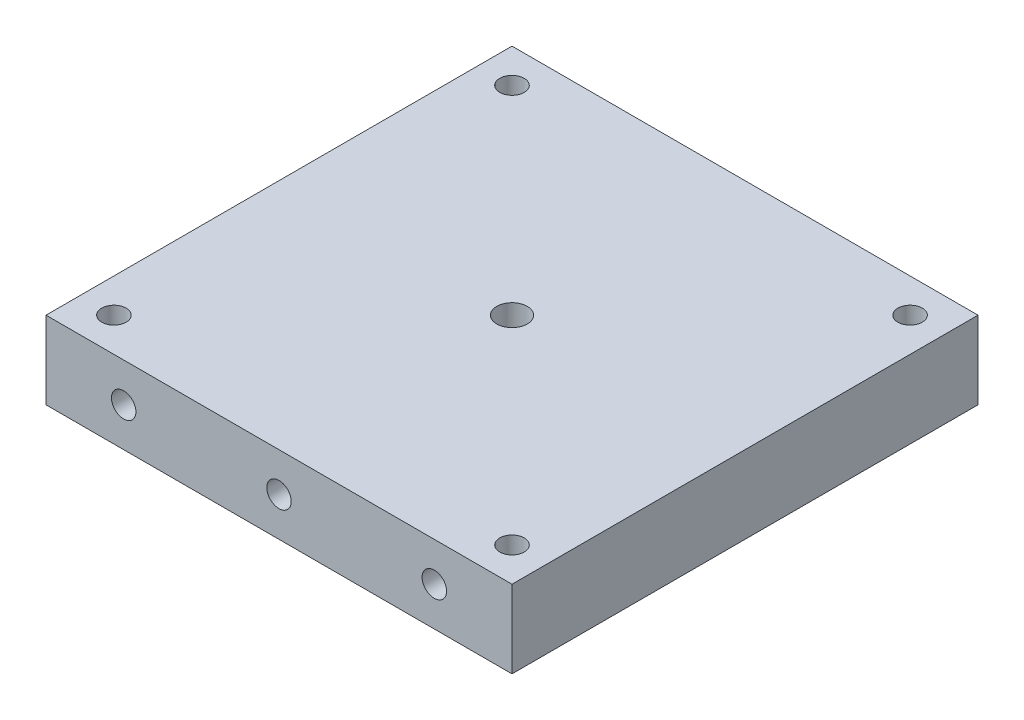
ISO-10303-21;
HEADER;
FILE_DESCRIPTION(('STEP AP214'),'2;1');
FILE_NAME('part.step','',(''),(''),'','','');
FILE_SCHEMA(('AUTOMOTIVE_DESIGN { 1 0 10303 214 1 1 1 1 }'));
ENDSEC;
DATA;
#1=APPLICATION_CONTEXT('core data for automotive mechanical design processes');
#2=APPLICATION_PROTOCOL_DEFINITION('international standard','automotive_design',2000,#1);
#3=PRODUCT_CONTEXT('',#1,'mechanical');
#4=PRODUCT('Part','Part','',(#3));
#5=PRODUCT_RELATED_PRODUCT_CATEGORY('part','',(#4));
#6=PRODUCT_DEFINITION_FORMATION('','',#4);
#7=PRODUCT_DEFINITION_CONTEXT('part definition',#1,'design');
#8=PRODUCT_DEFINITION('design','',#6,#7);
#9=PRODUCT_DEFINITION_SHAPE('','',#8);
#10=(LENGTH_UNIT() NAMED_UNIT(*) SI_UNIT(.MILLI.,.METRE.));
#11=(NAMED_UNIT(*) PLANE_ANGLE_UNIT() SI_UNIT($,.RADIAN.));
#12=(NAMED_UNIT(*) SI_UNIT($,.STERADIAN.) SOLID_ANGLE_UNIT());
#13=UNCERTAINTY_MEASURE_WITH_UNIT(LENGTH_MEASURE(1.E-05),#10,'distance_accuracy_value','');
#14=(GEOMETRIC_REPRESENTATION_CONTEXT(3) GLOBAL_UNCERTAINTY_ASSIGNED_CONTEXT((#13)) GLOBAL_UNIT_ASSIGNED_CONTEXT((#10,
#11,#12)) REPRESENTATION_CONTEXT('',''));
#15=CARTESIAN_POINT('',(0.,0.,0.));
#16=DIRECTION('',(0.,0.,1.));
#17=DIRECTION('',(1.,0.,0.));
#18=AXIS2_PLACEMENT_3D('',#15,#16,#17);
#19=CARTESIAN_POINT('',(-64.5530388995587,12.7,-17.4419074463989));
#20=DIRECTION('',(1.,0.,0.));
#21=DIRECTION('',(0.,0.,-1.));
#22=AXIS2_PLACEMENT_3D('',#19,#20,#21);
#23=PLANE('',#22);
#24=DIRECTION('',(0.,0.,1.));
#25=VECTOR('',#24,1.);
#26=CARTESIAN_POINT('',(-64.5530388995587,0.,-17.4419074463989));
#27=LINE('',#26,#25);
#28=CARTESIAN_POINT('',(-64.5530388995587,0.,-17.4419074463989));
#29=VERTEX_POINT('',#28);
#30=CARTESIAN_POINT('',(-64.5530388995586,0.,58.7580925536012));
#31=VERTEX_POINT('',#30);
#32=EDGE_CURVE('E149',#29,#31,#27,.T.);
#33=ORIENTED_EDGE('',*,*,#32,.T.);
#34=DIRECTION('',(0.,-1.,0.));
#35=VECTOR('',#34,1.);
#36=CARTESIAN_POINT('',(-64.5530388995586,12.7,58.7580925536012));
#37=LINE('',#36,#35);
#38=CARTESIAN_POINT('',(-64.5530388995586,12.7,58.7580925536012));
#39=VERTEX_POINT('',#38);
#40=EDGE_CURVE('E11',#39,#31,#37,.T.);
#41=ORIENTED_EDGE('',*,*,#40,.F.);
#42=DIRECTION('',(0.,0.,1.));
#43=VECTOR('',#42,1.);
#44=CARTESIAN_POINT('',(-64.5530388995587,12.7,-17.4419074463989));
#45=LINE('',#44,#43);
#46=CARTESIAN_POINT('',(-64.5530388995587,12.7,-17.4419074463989));
#47=VERTEX_POINT('',#46);
#48=EDGE_CURVE('E150',#47,#39,#45,.T.);
#49=ORIENTED_EDGE('',*,*,#48,.F.);
#50=DIRECTION('',(0.,-1.,0.));
#51=VECTOR('',#50,1.);
#52=CARTESIAN_POINT('',(-64.5530388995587,12.7,-17.4419074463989));
#53=LINE('',#52,#51);
#54=EDGE_CURVE('E156',#47,#29,#53,.T.);
#55=ORIENTED_EDGE('',*,*,#54,.T.);
#56=EDGE_LOOP('',(#33,#41,#49,#55));
#57=FACE_BOUND('',#56,.T.);
#58=ADVANCED_FACE('F32',(#57),#23,.F.);
#59=CARTESIAN_POINT('',(-64.5530388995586,12.7,58.7580925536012));
#60=DIRECTION('',(0.,0.,-1.));
#61=DIRECTION('',(-1.,0.,0.));
#62=AXIS2_PLACEMENT_3D('',#59,#60,#61);
#63=PLANE('',#62);
#64=CARTESIAN_POINT('',(-1.05303889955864,6.35,58.7580925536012));
#65=DIRECTION('',(0.,0.,1.));
#66=DIRECTION('',(1.,0.,0.));
#67=AXIS2_PLACEMENT_3D('',#64,#65,#66);
#68=CIRCLE('',#67,2.);
#69=CARTESIAN_POINT('',(0.946961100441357,6.35,58.7580925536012));
#70=VERTEX_POINT('',#69);
#71=EDGE_CURVE('E125',#70,#70,#68,.T.);
#72=ORIENTED_EDGE('',*,*,#71,.F.);
#73=EDGE_LOOP('',(#72));
#74=FACE_BOUND('',#73,.T.);
#75=CARTESIAN_POINT('',(-26.4530388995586,6.35,58.7580925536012));
#76=DIRECTION('',(0.,0.,1.));
#77=DIRECTION('',(1.,0.,0.));
#78=AXIS2_PLACEMENT_3D('',#75,#76,#77);
#79=CIRCLE('',#78,2.);
#80=CARTESIAN_POINT('',(-24.4530388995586,6.35,58.7580925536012));
#81=VERTEX_POINT('',#80);
#82=EDGE_CURVE('E129',#81,#81,#79,.T.);
#83=ORIENTED_EDGE('',*,*,#82,.F.);
#84=EDGE_LOOP('',(#83));
#85=FACE_BOUND('',#84,.T.);
#86=CARTESIAN_POINT('',(-51.8530388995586,6.35,58.7580925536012));
#87=DIRECTION('',(0.,0.,1.));
#88=DIRECTION('',(1.,0.,0.));
#89=AXIS2_PLACEMENT_3D('',#86,#87,#88);
#90=CIRCLE('',#89,2.);
#91=CARTESIAN_POINT('',(-49.8530388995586,6.35,58.7580925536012));
#92=VERTEX_POINT('',#91);
#93=EDGE_CURVE('E135',#92,#92,#90,.T.);
#94=ORIENTED_EDGE('',*,*,#93,.F.);
#95=EDGE_LOOP('',(#94));
#96=FACE_BOUND('',#95,.T.);
#97=DIRECTION('',(1.,0.,0.));
#98=VECTOR('',#97,1.);
#99=CARTESIAN_POINT('',(-64.5530388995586,0.,58.7580925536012));
#100=LINE('',#99,#98);
#101=CARTESIAN_POINT('',(11.6469611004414,0.,58.7580925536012));
#102=VERTEX_POINT('',#101);
#103=EDGE_CURVE('E159',#31,#102,#100,.T.);
#104=ORIENTED_EDGE('',*,*,#103,.T.);
#105=DIRECTION('',(0.,-1.,0.));
#106=VECTOR('',#105,1.);
#107=CARTESIAN_POINT('',(11.6469611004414,12.7,58.7580925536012));
#108=LINE('',#107,#106);
#109=CARTESIAN_POINT('',(11.6469611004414,12.7,58.7580925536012));
#110=VERTEX_POINT('',#109);
#111=EDGE_CURVE('E40',#110,#102,#108,.T.);
#112=ORIENTED_EDGE('',*,*,#111,.F.);
#113=DIRECTION('',(1.,0.,0.));
#114=VECTOR('',#113,1.);
#115=CARTESIAN_POINT('',(-64.5530388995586,12.7,58.7580925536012));
#116=LINE('',#115,#114);
#117=EDGE_CURVE('E79',#39,#110,#116,.T.);
#118=ORIENTED_EDGE('',*,*,#117,.F.);
#119=ORIENTED_EDGE('',*,*,#40,.T.);
#120=EDGE_LOOP('',(#104,#112,#118,#119));
#121=FACE_BOUND('',#120,.T.);
#122=ADVANCED_FACE('F183',(#74,#85,#96,#121),#63,.F.);
#123=CARTESIAN_POINT('',(11.6469611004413,12.7,-17.4419074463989));
#124=DIRECTION('',(-1.,0.,0.));
#125=DIRECTION('',(0.,0.,1.));
#126=AXIS2_PLACEMENT_3D('',#123,#124,#125);
#127=PLANE('',#126);
#128=DIRECTION('',(0.,0.,-1.));
#129=VECTOR('',#128,1.);
#130=CARTESIAN_POINT('',(11.6469611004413,0.,-17.4419074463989));
#131=LINE('',#130,#129);
#132=CARTESIAN_POINT('',(11.6469611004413,0.,-17.4419074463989));
#133=VERTEX_POINT('',#132);
#134=EDGE_CURVE('E66',#102,#133,#131,.T.);
#135=ORIENTED_EDGE('',*,*,#134,.T.);
#136=DIRECTION('',(0.,-1.,0.));
#137=VECTOR('',#136,1.);
#138=CARTESIAN_POINT('',(11.6469611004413,12.7,-17.4419074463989));
#139=LINE('',#138,#137);
#140=CARTESIAN_POINT('',(11.6469611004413,12.7,-17.4419074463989));
#141=VERTEX_POINT('',#140);
#142=EDGE_CURVE('E164',#141,#133,#139,.T.);
#143=ORIENTED_EDGE('',*,*,#142,.F.);
#144=DIRECTION('',(0.,0.,-1.));
#145=VECTOR('',#144,1.);
#146=CARTESIAN_POINT('',(11.6469611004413,12.7,-17.4419074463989));
#147=LINE('',#146,#145);
#148=EDGE_CURVE('E153',#110,#141,#147,.T.);
#149=ORIENTED_EDGE('',*,*,#148,.F.);
#150=ORIENTED_EDGE('',*,*,#111,.T.);
#151=EDGE_LOOP('',(#135,#143,#149,#150));
#152=FACE_BOUND('',#151,.T.);
#153=ADVANCED_FACE('F166',(#152),#127,.F.);
#154=CARTESIAN_POINT('',(-64.5530388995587,12.7,-17.4419074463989));
#155=DIRECTION('',(0.,0.,1.));
#156=DIRECTION('',(1.,0.,0.));
#157=AXIS2_PLACEMENT_3D('',#154,#155,#156);
#158=PLANE('',#157);
#159=DIRECTION('',(-1.,0.,0.));
#160=VECTOR('',#159,1.);
#161=CARTESIAN_POINT('',(-64.5530388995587,0.,-17.4419074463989));
#162=LINE('',#161,#160);
#163=EDGE_CURVE('E72',#133,#29,#162,.T.);
#164=ORIENTED_EDGE('',*,*,#163,.T.);
#165=ORIENTED_EDGE('',*,*,#54,.F.);
#166=DIRECTION('',(-1.,0.,0.));
#167=VECTOR('',#166,1.);
#168=CARTESIAN_POINT('',(-64.5530388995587,12.7,-17.4419074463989));
#169=LINE('',#168,#167);
#170=EDGE_CURVE('E48',#141,#47,#169,.T.);
#171=ORIENTED_EDGE('',*,*,#170,.F.);
#172=ORIENTED_EDGE('',*,*,#142,.T.);
#173=EDGE_LOOP('',(#164,#165,#171,#172));
#174=FACE_BOUND('',#173,.T.);
#175=ADVANCED_FACE('F173',(#174),#158,.F.);
#176=CARTESIAN_POINT('',(-64.5530388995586,12.7,58.7580925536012));
#177=DIRECTION('',(0.,1.,0.));
#178=DIRECTION('',(0.,0.,1.));
#179=AXIS2_PLACEMENT_3D('',#176,#177,#178);
#180=PLANE('',#179);
#181=CARTESIAN_POINT('',(-58.9967888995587,12.7,-11.8856574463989));
#182=DIRECTION('',(0.,1.,0.));
#183=DIRECTION('',(0.,0.,1.));
#184=AXIS2_PLACEMENT_3D('',#181,#182,#183);
#185=CIRCLE('',#184,1.99999999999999);
#186=CARTESIAN_POINT('',(-58.9967888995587,12.7,-9.88565744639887));
#187=VERTEX_POINT('',#186);
#188=EDGE_CURVE('E103',#187,#187,#185,.T.);
#189=ORIENTED_EDGE('',*,*,#188,.F.);
#190=EDGE_LOOP('',(#189));
#191=FACE_BOUND('',#190,.T.);
#192=CARTESIAN_POINT('',(6.09071110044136,12.7,-11.8856574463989));
#193=DIRECTION('',(0.,1.,0.));
#194=DIRECTION('',(0.,0.,1.));
#195=AXIS2_PLACEMENT_3D('',#192,#193,#194);
#196=CIRCLE('',#195,1.99999999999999);
#197=CARTESIAN_POINT('',(6.09071110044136,12.7,-9.88565744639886));
#198=VERTEX_POINT('',#197);
#199=EDGE_CURVE('E102',#198,#198,#196,.T.);
#200=ORIENTED_EDGE('',*,*,#199,.F.);
#201=EDGE_LOOP('',(#200));
#202=FACE_BOUND('',#201,.T.);
#203=CARTESIAN_POINT('',(6.09071110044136,12.7,53.2018425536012));
#204=DIRECTION('',(0.,1.,0.));
#205=DIRECTION('',(0.,0.,1.));
#206=AXIS2_PLACEMENT_3D('',#203,#204,#205);
#207=CIRCLE('',#206,1.99999999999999);
#208=CARTESIAN_POINT('',(6.09071110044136,12.7,55.2018425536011));
#209=VERTEX_POINT('',#208);
#210=EDGE_CURVE('E113',#209,#209,#207,.T.);
#211=ORIENTED_EDGE('',*,*,#210,.F.);
#212=EDGE_LOOP('',(#211));
#213=FACE_BOUND('',#212,.T.);
#214=CARTESIAN_POINT('',(-58.9967888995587,12.7,53.2018425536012));
#215=DIRECTION('',(0.,1.,0.));
#216=DIRECTION('',(0.,0.,1.));
#217=AXIS2_PLACEMENT_3D('',#214,#215,#216);
#218=CIRCLE('',#217,1.99999999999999);
#219=CARTESIAN_POINT('',(-58.9967888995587,12.7,55.2018425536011));
#220=VERTEX_POINT('',#219);
#221=EDGE_CURVE('E119',#220,#220,#218,.T.);
#222=ORIENTED_EDGE('',*,*,#221,.F.);
#223=EDGE_LOOP('',(#222));
#224=FACE_BOUND('',#223,.T.);
#225=CARTESIAN_POINT('',(-26.4530388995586,12.7,20.6580925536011));
#226=DIRECTION('',(0.,1.,0.));
#227=DIRECTION('',(0.,0.,1.));
#228=AXIS2_PLACEMENT_3D('',#225,#226,#227);
#229=CIRCLE('',#228,2.49999999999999);
#230=CARTESIAN_POINT('',(-26.4530388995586,12.7,23.1580925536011));
#231=VERTEX_POINT('',#230);
#232=EDGE_CURVE('E141',#231,#231,#229,.T.);
#233=ORIENTED_EDGE('',*,*,#232,.F.);
#234=EDGE_LOOP('',(#233));
#235=FACE_BOUND('',#234,.T.);
#236=ORIENTED_EDGE('',*,*,#48,.T.);
#237=ORIENTED_EDGE('',*,*,#117,.T.);
#238=ORIENTED_EDGE('',*,*,#148,.T.);
#239=ORIENTED_EDGE('',*,*,#170,.T.);
#240=EDGE_LOOP('',(#236,#237,#238,#239));
#241=FACE_BOUND('',#240,.T.);
#242=ADVANCED_FACE('F175',(#191,#202,#213,#224,#235,#241),#180,.T.);
#243=CARTESIAN_POINT('',(-64.5530388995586,0.,58.7580925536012));
#244=DIRECTION('',(0.,1.,0.));
#245=DIRECTION('',(0.,0.,1.));
#246=AXIS2_PLACEMENT_3D('',#243,#244,#245);
#247=PLANE('',#246);
#248=CARTESIAN_POINT('',(-26.4530388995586,0.,20.6580925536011));
#249=DIRECTION('',(0.,1.,0.));
#250=DIRECTION('',(0.,0.,1.));
#251=AXIS2_PLACEMENT_3D('',#248,#249,#250);
#252=CIRCLE('',#251,2.5);
#253=CARTESIAN_POINT('',(-26.4530388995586,0.,23.1580925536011));
#254=VERTEX_POINT('',#253);
#255=EDGE_CURVE('E146',#254,#254,#252,.T.);
#256=ORIENTED_EDGE('',*,*,#255,.T.);
#257=EDGE_LOOP('',(#256));
#258=FACE_BOUND('',#257,.T.);
#259=ORIENTED_EDGE('',*,*,#32,.F.);
#260=ORIENTED_EDGE('',*,*,#163,.F.);
#261=ORIENTED_EDGE('',*,*,#134,.F.);
#262=ORIENTED_EDGE('',*,*,#103,.F.);
#263=EDGE_LOOP('',(#259,#260,#261,#262));
#264=FACE_BOUND('',#263,.T.);
#265=ADVANCED_FACE('F169',(#258,#264),#247,.F.);
#266=CARTESIAN_POINT('',(-26.4530388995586,12.7,20.6580925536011));
#267=DIRECTION('',(0.,1.,0.));
#268=DIRECTION('',(0.,0.,1.));
#269=AXIS2_PLACEMENT_3D('',#266,#267,#268);
#270=CYLINDRICAL_SURFACE('',#269,2.49999999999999);
#271=ORIENTED_EDGE('',*,*,#255,.F.);
#272=EDGE_LOOP('',(#271));
#273=FACE_BOUND('',#272,.T.);
#274=ORIENTED_EDGE('',*,*,#232,.T.);
#275=EDGE_LOOP('',(#274));
#276=FACE_BOUND('',#275,.T.);
#277=ADVANCED_FACE('F202',(#273,#276),#270,.F.);
#278=CARTESIAN_POINT('',(-51.8530388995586,6.35,33.3580925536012));
#279=DIRECTION('',(0.,0.,1.));
#280=DIRECTION('',(1.,0.,0.));
#281=AXIS2_PLACEMENT_3D('',#278,#279,#280);
#282=CYLINDRICAL_SURFACE('',#281,2.);
#283=CARTESIAN_POINT('',(-51.8530388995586,6.35,33.3580925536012));
#284=DIRECTION('',(0.,0.,1.));
#285=DIRECTION('',(1.,0.,0.));
#286=AXIS2_PLACEMENT_3D('',#283,#284,#285);
#287=CIRCLE('',#286,2.);
#288=CARTESIAN_POINT('',(-49.8530388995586,6.35,33.3580925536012));
#289=VERTEX_POINT('',#288);
#290=EDGE_CURVE('E138',#289,#289,#287,.T.);
#291=ORIENTED_EDGE('',*,*,#290,.F.);
#292=EDGE_LOOP('',(#291));
#293=FACE_BOUND('',#292,.T.);
#294=ORIENTED_EDGE('',*,*,#93,.T.);
#295=EDGE_LOOP('',(#294));
#296=FACE_BOUND('',#295,.T.);
#297=ADVANCED_FACE('F199',(#293,#296),#282,.F.);
#298=CARTESIAN_POINT('',(-51.8530388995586,6.35,33.3580925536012));
#299=DIRECTION('',(0.,0.,1.));
#300=DIRECTION('',(1.,0.,0.));
#301=AXIS2_PLACEMENT_3D('',#298,#299,#300);
#302=PLANE('',#301);
#303=ORIENTED_EDGE('',*,*,#290,.T.);
#304=EDGE_LOOP('',(#303));
#305=FACE_BOUND('',#304,.T.);
#306=ADVANCED_FACE('F201',(#305),#302,.T.);
#307=CARTESIAN_POINT('',(-26.4530388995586,6.35,33.3580925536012));
#308=DIRECTION('',(0.,0.,1.));
#309=DIRECTION('',(1.,0.,0.));
#310=AXIS2_PLACEMENT_3D('',#307,#308,#309);
#311=CYLINDRICAL_SURFACE('',#310,2.);
#312=CARTESIAN_POINT('',(-26.4530388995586,6.35,33.3580925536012));
#313=DIRECTION('',(0.,0.,1.));
#314=DIRECTION('',(1.,0.,0.));
#315=AXIS2_PLACEMENT_3D('',#312,#313,#314);
#316=CIRCLE('',#315,2.);
#317=CARTESIAN_POINT('',(-24.4530388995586,6.35,33.3580925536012));
#318=VERTEX_POINT('',#317);
#319=EDGE_CURVE('E132',#318,#318,#316,.T.);
#320=ORIENTED_EDGE('',*,*,#319,.F.);
#321=EDGE_LOOP('',(#320));
#322=FACE_BOUND('',#321,.T.);
#323=ORIENTED_EDGE('',*,*,#82,.T.);
#324=EDGE_LOOP('',(#323));
#325=FACE_BOUND('',#324,.T.);
#326=ADVANCED_FACE('F209',(#322,#325),#311,.F.);
#327=CARTESIAN_POINT('',(-26.4530388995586,6.35,33.3580925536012));
#328=DIRECTION('',(0.,0.,1.));
#329=DIRECTION('',(1.,0.,0.));
#330=AXIS2_PLACEMENT_3D('',#327,#328,#329);
#331=PLANE('',#330);
#332=ORIENTED_EDGE('',*,*,#319,.T.);
#333=EDGE_LOOP('',(#332));
#334=FACE_BOUND('',#333,.T.);
#335=ADVANCED_FACE('F255',(#334),#331,.T.);
#336=CARTESIAN_POINT('',(-1.05303889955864,6.35,33.3580925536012));
#337=DIRECTION('',(0.,0.,1.));
#338=DIRECTION('',(1.,0.,0.));
#339=AXIS2_PLACEMENT_3D('',#336,#337,#338);
#340=CYLINDRICAL_SURFACE('',#339,2.);
#341=CARTESIAN_POINT('',(-1.05303889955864,6.35,33.3580925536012));
#342=DIRECTION('',(0.,0.,1.));
#343=DIRECTION('',(1.,0.,0.));
#344=AXIS2_PLACEMENT_3D('',#341,#342,#343);
#345=CIRCLE('',#344,2.);
#346=CARTESIAN_POINT('',(0.946961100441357,6.35,33.3580925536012));
#347=VERTEX_POINT('',#346);
#348=EDGE_CURVE('E126',#347,#347,#345,.T.);
#349=ORIENTED_EDGE('',*,*,#348,.F.);
#350=EDGE_LOOP('',(#349));
#351=FACE_BOUND('',#350,.T.);
#352=ORIENTED_EDGE('',*,*,#71,.T.);
#353=EDGE_LOOP('',(#352));
#354=FACE_BOUND('',#353,.T.);
#355=ADVANCED_FACE('F264',(#351,#354),#340,.F.);
#356=CARTESIAN_POINT('',(-1.05303889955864,6.35,33.3580925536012));
#357=DIRECTION('',(0.,0.,1.));
#358=DIRECTION('',(1.,0.,0.));
#359=AXIS2_PLACEMENT_3D('',#356,#357,#358);
#360=PLANE('',#359);
#361=ORIENTED_EDGE('',*,*,#348,.T.);
#362=EDGE_LOOP('',(#361));
#363=FACE_BOUND('',#362,.T.);
#364=ADVANCED_FACE('F274',(#363),#360,.T.);
#365=CARTESIAN_POINT('',(-58.9967888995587,6.35,53.2018425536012));
#366=DIRECTION('',(0.,1.,0.));
#367=DIRECTION('',(0.,0.,1.));
#368=AXIS2_PLACEMENT_3D('',#365,#366,#367);
#369=CONICAL_SURFACE('',#368,1.99999999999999,1.02974425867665);
#370=CARTESIAN_POINT('',(-58.9967888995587,5.14827876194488,53.2018425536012));
#371=VERTEX_POINT('',#370);
#372=VERTEX_LOOP('',#371);
#373=FACE_BOUND('',#372,.T.);
#374=CARTESIAN_POINT('',(-58.9967888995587,6.35,53.2018425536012));
#375=DIRECTION('',(0.,1.,0.));
#376=DIRECTION('',(0.,0.,1.));
#377=AXIS2_PLACEMENT_3D('',#374,#375,#376);
#378=CIRCLE('',#377,1.99999999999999);
#379=CARTESIAN_POINT('',(-58.9967888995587,6.35,55.2018425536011));
#380=VERTEX_POINT('',#379);
#381=EDGE_CURVE('E122',#380,#380,#378,.T.);
#382=ORIENTED_EDGE('',*,*,#381,.T.);
#383=EDGE_LOOP('',(#382));
#384=FACE_BOUND('',#383,.T.);
#385=ADVANCED_FACE('F283',(#373,#384),#369,.F.);
#386=CARTESIAN_POINT('',(-58.9967888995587,12.7,53.2018425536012));
#387=DIRECTION('',(0.,1.,0.));
#388=DIRECTION('',(0.,0.,1.));
#389=AXIS2_PLACEMENT_3D('',#386,#387,#388);
#390=CYLINDRICAL_SURFACE('',#389,1.99999999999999);
#391=ORIENTED_EDGE('',*,*,#381,.F.);
#392=EDGE_LOOP('',(#391));
#393=FACE_BOUND('',#392,.T.);
#394=ORIENTED_EDGE('',*,*,#221,.T.);
#395=EDGE_LOOP('',(#394));
#396=FACE_BOUND('',#395,.T.);
#397=ADVANCED_FACE('F299',(#393,#396),#390,.F.);
#398=CARTESIAN_POINT('',(6.09071110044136,6.35,53.2018425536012));
#399=DIRECTION('',(0.,1.,0.));
#400=DIRECTION('',(0.,0.,1.));
#401=AXIS2_PLACEMENT_3D('',#398,#399,#400);
#402=CONICAL_SURFACE('',#401,2.,1.02974425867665);
#403=CARTESIAN_POINT('',(6.09071110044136,5.14827876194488,53.2018425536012));
#404=VERTEX_POINT('',#403);
#405=VERTEX_LOOP('',#404);
#406=FACE_BOUND('',#405,.T.);
#407=CARTESIAN_POINT('',(6.09071110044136,6.35,53.2018425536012));
#408=DIRECTION('',(0.,1.,0.));
#409=DIRECTION('',(0.,0.,1.));
#410=AXIS2_PLACEMENT_3D('',#407,#408,#409);
#411=CIRCLE('',#410,2.);
#412=CARTESIAN_POINT('',(6.09071110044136,6.35,55.2018425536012));
#413=VERTEX_POINT('',#412);
#414=EDGE_CURVE('E116',#413,#413,#411,.T.);
#415=ORIENTED_EDGE('',*,*,#414,.T.);
#416=EDGE_LOOP('',(#415));
#417=FACE_BOUND('',#416,.T.);
#418=ADVANCED_FACE('F309',(#406,#417),#402,.F.);
#419=CARTESIAN_POINT('',(6.09071110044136,12.7,53.2018425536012));
#420=DIRECTION('',(0.,1.,0.));
#421=DIRECTION('',(0.,0.,1.));
#422=AXIS2_PLACEMENT_3D('',#419,#420,#421);
#423=CYLINDRICAL_SURFACE('',#422,1.99999999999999);
#424=ORIENTED_EDGE('',*,*,#414,.F.);
#425=EDGE_LOOP('',(#424));
#426=FACE_BOUND('',#425,.T.);
#427=ORIENTED_EDGE('',*,*,#210,.T.);
#428=EDGE_LOOP('',(#427));
#429=FACE_BOUND('',#428,.T.);
#430=ADVANCED_FACE('F319',(#426,#429),#423,.F.);
#431=CARTESIAN_POINT('',(6.09071110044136,6.35,-11.8856574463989));
#432=DIRECTION('',(0.,1.,0.));
#433=DIRECTION('',(0.,0.,1.));
#434=AXIS2_PLACEMENT_3D('',#431,#432,#433);
#435=CONICAL_SURFACE('',#434,2.,1.02974425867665);
#436=CARTESIAN_POINT('',(6.09071110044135,5.14827876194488,-11.8856574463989));
#437=VERTEX_POINT('',#436);
#438=VERTEX_LOOP('',#437);
#439=FACE_BOUND('',#438,.T.);
#440=CARTESIAN_POINT('',(6.09071110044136,6.35,-11.8856574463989));
#441=DIRECTION('',(0.,1.,0.));
#442=DIRECTION('',(0.,0.,1.));
#443=AXIS2_PLACEMENT_3D('',#440,#441,#442);
#444=CIRCLE('',#443,2.);
#445=CARTESIAN_POINT('',(6.09071110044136,6.35,-9.88565744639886));
#446=VERTEX_POINT('',#445);
#447=EDGE_CURVE('E106',#446,#446,#444,.T.);
#448=ORIENTED_EDGE('',*,*,#447,.T.);
#449=EDGE_LOOP('',(#448));
#450=FACE_BOUND('',#449,.T.);
#451=ADVANCED_FACE('F329',(#439,#450),#435,.F.);
#452=CARTESIAN_POINT('',(6.09071110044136,12.7,-11.8856574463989));
#453=DIRECTION('',(0.,1.,0.));
#454=DIRECTION('',(0.,0.,1.));
#455=AXIS2_PLACEMENT_3D('',#452,#453,#454);
#456=CYLINDRICAL_SURFACE('',#455,1.99999999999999);
#457=ORIENTED_EDGE('',*,*,#447,.F.);
#458=EDGE_LOOP('',(#457));
#459=FACE_BOUND('',#458,.T.);
#460=ORIENTED_EDGE('',*,*,#199,.T.);
#461=EDGE_LOOP('',(#460));
#462=FACE_BOUND('',#461,.T.);
#463=ADVANCED_FACE('F96',(#459,#462),#456,.F.);
#464=CARTESIAN_POINT('',(-58.9967888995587,6.35,-11.8856574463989));
#465=DIRECTION('',(0.,1.,0.));
#466=DIRECTION('',(0.,0.,1.));
#467=AXIS2_PLACEMENT_3D('',#464,#465,#466);
#468=CONICAL_SURFACE('',#467,1.99999999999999,1.02974425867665);
#469=CARTESIAN_POINT('',(-58.9967888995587,5.14827876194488,-11.8856574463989));
#470=VERTEX_POINT('',#469);
#471=VERTEX_LOOP('',#470);
#472=FACE_BOUND('',#471,.T.);
#473=CARTESIAN_POINT('',(-58.9967888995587,6.35,-11.8856574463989));
#474=DIRECTION('',(0.,1.,0.));
#475=DIRECTION('',(0.,0.,1.));
#476=AXIS2_PLACEMENT_3D('',#473,#474,#475);
#477=CIRCLE('',#476,1.99999999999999);
#478=CARTESIAN_POINT('',(-58.9967888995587,6.35,-9.88565744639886));
#479=VERTEX_POINT('',#478);
#480=EDGE_CURVE('E100',#479,#479,#477,.T.);
#481=ORIENTED_EDGE('',*,*,#480,.T.);
#482=EDGE_LOOP('',(#481));
#483=FACE_BOUND('',#482,.T.);
#484=ADVANCED_FACE('F92',(#472,#483),#468,.F.);
#485=CARTESIAN_POINT('',(-58.9967888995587,12.7,-11.8856574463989));
#486=DIRECTION('',(0.,1.,0.));
#487=DIRECTION('',(0.,0.,1.));
#488=AXIS2_PLACEMENT_3D('',#485,#486,#487);
#489=CYLINDRICAL_SURFACE('',#488,1.99999999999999);
#490=ORIENTED_EDGE('',*,*,#480,.F.);
#491=EDGE_LOOP('',(#490));
#492=FACE_BOUND('',#491,.T.);
#493=ORIENTED_EDGE('',*,*,#188,.T.);
#494=EDGE_LOOP('',(#493));
#495=FACE_BOUND('',#494,.T.);
#496=ADVANCED_FACE('F95',(#492,#495),#489,.F.);
#497=CLOSED_SHELL('',(#58,#122,#153,#175,#242,#265,#277,#297,#306,#326,#335,#355,#364,#385,#397,
#418,#430,#451,#463,#484,#496));
#498=MANIFOLD_SOLID_BREP('B2',#497);
#499=ADVANCED_BREP_SHAPE_REPRESENTATION('',(#18,#498),#14);
#500=SHAPE_DEFINITION_REPRESENTATION(#9,#499);
ENDSEC;
END-ISO-10303-21;
